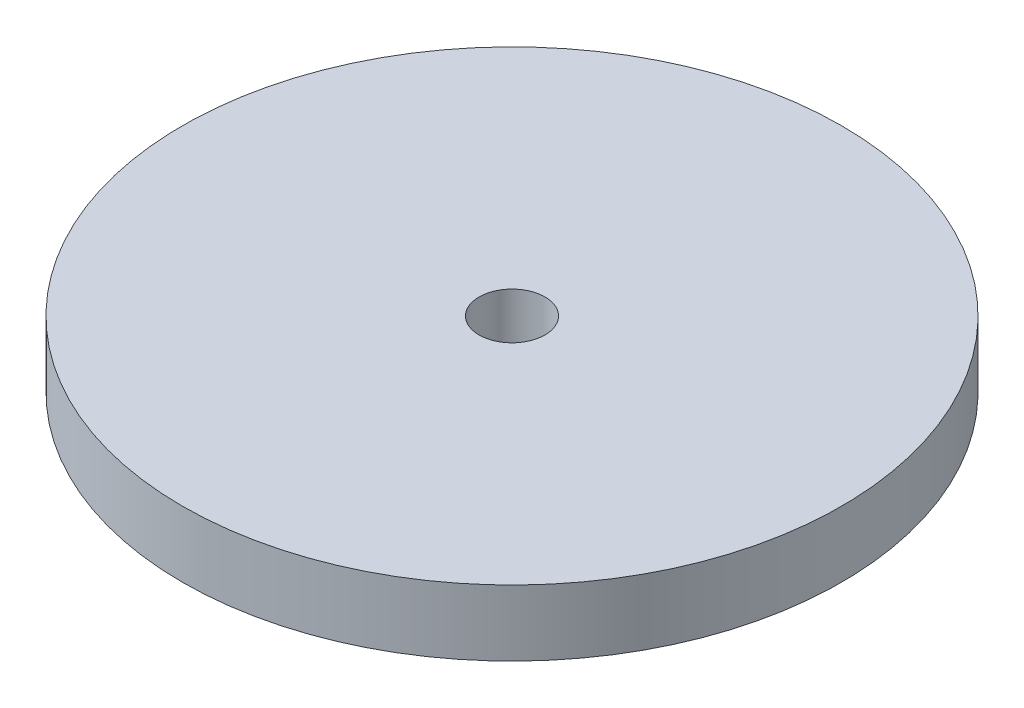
ISO-10303-21;
HEADER;
FILE_DESCRIPTION(('STEP AP214'),'2;1');
FILE_NAME('part.step','',(''),(''),'','','');
FILE_SCHEMA(('AUTOMOTIVE_DESIGN { 1 0 10303 214 1 1 1 1 }'));
ENDSEC;
DATA;
#1=APPLICATION_CONTEXT('core data for automotive mechanical design processes');
#2=APPLICATION_PROTOCOL_DEFINITION('international standard','automotive_design',2000,#1);
#3=PRODUCT_CONTEXT('',#1,'mechanical');
#4=PRODUCT('Part','Part','',(#3));
#5=PRODUCT_RELATED_PRODUCT_CATEGORY('part','',(#4));
#6=PRODUCT_DEFINITION_FORMATION('','',#4);
#7=PRODUCT_DEFINITION_CONTEXT('part definition',#1,'design');
#8=PRODUCT_DEFINITION('design','',#6,#7);
#9=PRODUCT_DEFINITION_SHAPE('','',#8);
#10=(LENGTH_UNIT() NAMED_UNIT(*) SI_UNIT(.MILLI.,.METRE.));
#11=(NAMED_UNIT(*) PLANE_ANGLE_UNIT() SI_UNIT($,.RADIAN.));
#12=(NAMED_UNIT(*) SI_UNIT($,.STERADIAN.) SOLID_ANGLE_UNIT());
#13=UNCERTAINTY_MEASURE_WITH_UNIT(LENGTH_MEASURE(1.E-05),#10,'distance_accuracy_value','');
#14=(GEOMETRIC_REPRESENTATION_CONTEXT(3) GLOBAL_UNCERTAINTY_ASSIGNED_CONTEXT((#13)) GLOBAL_UNIT_ASSIGNED_CONTEXT((#10,
#11,#12)) REPRESENTATION_CONTEXT('',''));
#15=CARTESIAN_POINT('',(0.,0.,0.));
#16=DIRECTION('',(0.,0.,1.));
#17=DIRECTION('',(1.,0.,0.));
#18=AXIS2_PLACEMENT_3D('',#15,#16,#17);
#19=CARTESIAN_POINT('',(-8.47001000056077,6.35,-3.25769615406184));
#20=DIRECTION('',(0.,1.,0.));
#21=DIRECTION('',(0.,0.,1.));
#22=AXIS2_PLACEMENT_3D('',#19,#20,#21);
#23=PLANE('',#22);
#24=CARTESIAN_POINT('',(-8.47001000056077,6.35,-3.25769615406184));
#25=DIRECTION('',(0.,1.,0.));
#26=DIRECTION('',(0.,0.,1.));
#27=AXIS2_PLACEMENT_3D('',#24,#25,#26);
#28=CIRCLE('',#27,31.75);
#29=CARTESIAN_POINT('',(-8.47001000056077,6.35,28.4923038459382));
#30=VERTEX_POINT('',#29);
#31=EDGE_CURVE('E10',#30,#30,#28,.T.);
#32=ORIENTED_EDGE('',*,*,#31,.T.);
#33=EDGE_LOOP('',(#32));
#34=FACE_BOUND('',#33,.T.);
#35=CARTESIAN_POINT('',(-8.47001000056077,6.35,-3.25769615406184));
#36=DIRECTION('',(0.,1.,0.));
#37=DIRECTION('',(0.,0.,1.));
#38=AXIS2_PLACEMENT_3D('',#35,#36,#37);
#39=CIRCLE('',#38,3.175);
#40=CARTESIAN_POINT('',(-8.47001000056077,6.35,-0.0826961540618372));
#41=VERTEX_POINT('',#40);
#42=EDGE_CURVE('E40',#41,#41,#39,.T.);
#43=ORIENTED_EDGE('',*,*,#42,.F.);
#44=EDGE_LOOP('',(#43));
#45=FACE_BOUND('',#44,.T.);
#46=ADVANCED_FACE('F29',(#34,#45),#23,.T.);
#47=CARTESIAN_POINT('',(-8.47001000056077,0.,-3.25769615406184));
#48=DIRECTION('',(0.,1.,0.));
#49=DIRECTION('',(0.,0.,1.));
#50=AXIS2_PLACEMENT_3D('',#47,#48,#49);
#51=PLANE('',#50);
#52=CARTESIAN_POINT('',(-8.47001000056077,0.,-3.25769615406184));
#53=DIRECTION('',(0.,1.,0.));
#54=DIRECTION('',(0.,0.,1.));
#55=AXIS2_PLACEMENT_3D('',#52,#53,#54);
#56=CIRCLE('',#55,31.75);
#57=CARTESIAN_POINT('',(-8.47001000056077,0.,28.4923038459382));
#58=VERTEX_POINT('',#57);
#59=EDGE_CURVE('E33',#58,#58,#56,.T.);
#60=ORIENTED_EDGE('',*,*,#59,.F.);
#61=EDGE_LOOP('',(#60));
#62=FACE_BOUND('',#61,.T.);
#63=CARTESIAN_POINT('',(-8.47001000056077,0.,-3.25769615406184));
#64=DIRECTION('',(0.,1.,0.));
#65=DIRECTION('',(0.,0.,1.));
#66=AXIS2_PLACEMENT_3D('',#63,#64,#65);
#67=CIRCLE('',#66,3.175);
#68=CARTESIAN_POINT('',(-8.47001000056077,0.,-0.0826961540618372));
#69=VERTEX_POINT('',#68);
#70=EDGE_CURVE('E42',#69,#69,#67,.T.);
#71=ORIENTED_EDGE('',*,*,#70,.T.);
#72=EDGE_LOOP('',(#71));
#73=FACE_BOUND('',#72,.T.);
#74=ADVANCED_FACE('F52',(#62,#73),#51,.F.);
#75=CARTESIAN_POINT('',(-8.47001000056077,6.35,-3.25769615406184));
#76=DIRECTION('',(0.,-1.,0.));
#77=DIRECTION('',(0.,0.,-1.));
#78=AXIS2_PLACEMENT_3D('',#75,#76,#77);
#79=CYLINDRICAL_SURFACE('',#78,31.75);
#80=ORIENTED_EDGE('',*,*,#31,.F.);
#81=EDGE_LOOP('',(#80));
#82=FACE_BOUND('',#81,.T.);
#83=ORIENTED_EDGE('',*,*,#59,.T.);
#84=EDGE_LOOP('',(#83));
#85=FACE_BOUND('',#84,.T.);
#86=ADVANCED_FACE('F31',(#82,#85),#79,.T.);
#87=CARTESIAN_POINT('',(-8.47001000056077,6.35,-3.25769615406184));
#88=DIRECTION('',(0.,-1.,0.));
#89=DIRECTION('',(0.,0.,-1.));
#90=AXIS2_PLACEMENT_3D('',#87,#88,#89);
#91=CYLINDRICAL_SURFACE('',#90,3.175);
#92=ORIENTED_EDGE('',*,*,#42,.T.);
#93=EDGE_LOOP('',(#92));
#94=FACE_BOUND('',#93,.T.);
#95=ORIENTED_EDGE('',*,*,#70,.F.);
#96=EDGE_LOOP('',(#95));
#97=FACE_BOUND('',#96,.T.);
#98=ADVANCED_FACE('F48',(#94,#97),#91,.F.);
#99=CLOSED_SHELL('',(#46,#74,#86,#98));
#100=MANIFOLD_SOLID_BREP('B2',#99);
#101=ADVANCED_BREP_SHAPE_REPRESENTATION('',(#18,#100),#14);
#102=SHAPE_DEFINITION_REPRESENTATION(#9,#101);
ENDSEC;
END-ISO-10303-21;
